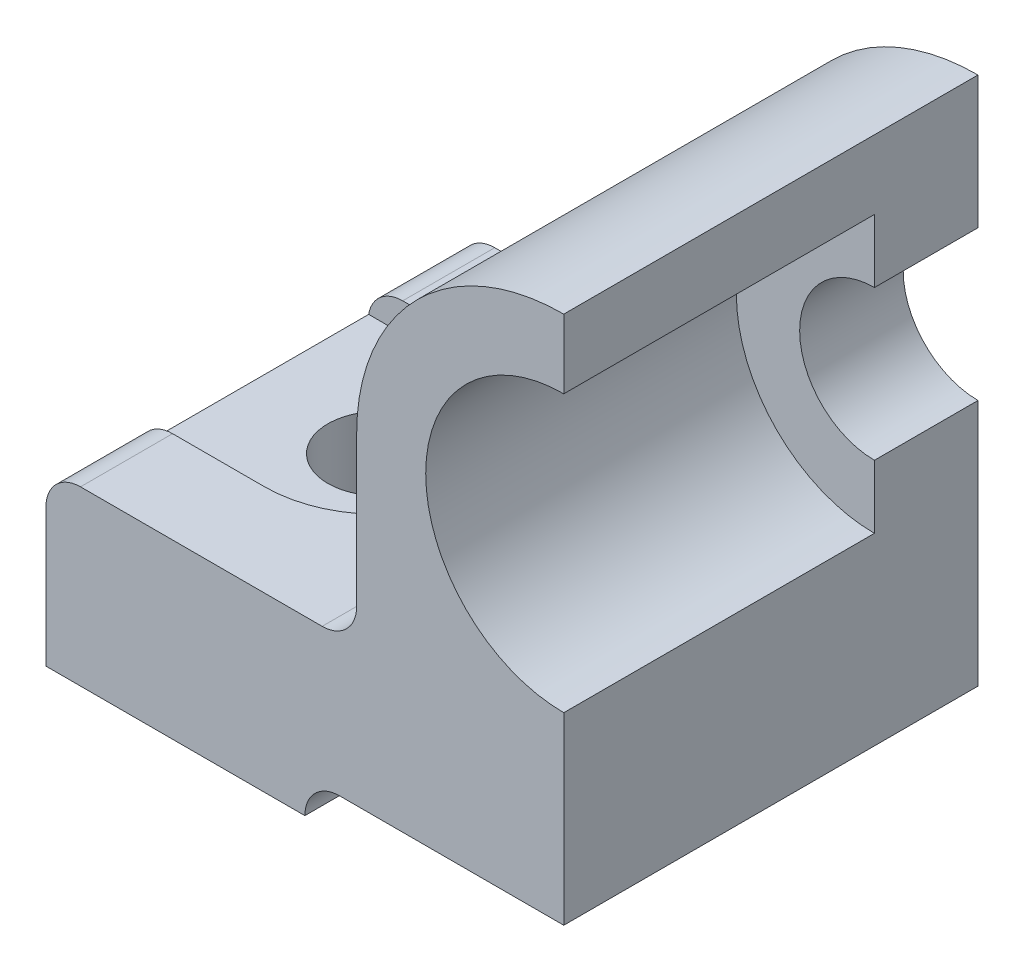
ISO-10303-21;
HEADER;
FILE_DESCRIPTION(('STEP AP214'),'2;1');
FILE_NAME('part.step','',(''),(''),'','','');
FILE_SCHEMA(('AUTOMOTIVE_DESIGN { 1 0 10303 214 1 1 1 1 }'));
ENDSEC;
DATA;
#1=APPLICATION_CONTEXT('core data for automotive mechanical design processes');
#2=APPLICATION_PROTOCOL_DEFINITION('international standard','automotive_design',2000,#1);
#3=PRODUCT_CONTEXT('',#1,'mechanical');
#4=PRODUCT('Part','Part','',(#3));
#5=PRODUCT_RELATED_PRODUCT_CATEGORY('part','',(#4));
#6=PRODUCT_DEFINITION_FORMATION('','',#4);
#7=PRODUCT_DEFINITION_CONTEXT('part definition',#1,'design');
#8=PRODUCT_DEFINITION('design','',#6,#7);
#9=PRODUCT_DEFINITION_SHAPE('','',#8);
#10=(LENGTH_UNIT() NAMED_UNIT(*) SI_UNIT(.MILLI.,.METRE.));
#11=(NAMED_UNIT(*) PLANE_ANGLE_UNIT() SI_UNIT($,.RADIAN.));
#12=(NAMED_UNIT(*) SI_UNIT($,.STERADIAN.) SOLID_ANGLE_UNIT());
#13=UNCERTAINTY_MEASURE_WITH_UNIT(LENGTH_MEASURE(1.E-05),#10,'distance_accuracy_value','');
#14=(GEOMETRIC_REPRESENTATION_CONTEXT(3) GLOBAL_UNCERTAINTY_ASSIGNED_CONTEXT((#13)) GLOBAL_UNIT_ASSIGNED_CONTEXT((#10,
#11,#12)) REPRESENTATION_CONTEXT('',''));
#15=CARTESIAN_POINT('',(0.,0.,0.));
#16=DIRECTION('',(0.,0.,1.));
#17=DIRECTION('',(1.,0.,0.));
#18=AXIS2_PLACEMENT_3D('',#15,#16,#17);
#19=CARTESIAN_POINT('',(0.,0.,-36.));
#20=DIRECTION('',(0.,-1.,0.));
#21=DIRECTION('',(0.,0.,-1.));
#22=AXIS2_PLACEMENT_3D('',#19,#20,#21);
#23=PLANE('',#22);
#24=DIRECTION('',(1.,0.,0.));
#25=VECTOR('',#24,1.);
#26=CARTESIAN_POINT('',(0.,0.,0.));
#27=LINE('',#26,#25);
#28=CARTESIAN_POINT('',(0.,0.,0.));
#29=VERTEX_POINT('',#28);
#30=CARTESIAN_POINT('',(22.5,0.,0.));
#31=VERTEX_POINT('',#30);
#32=EDGE_CURVE('E184',#29,#31,#27,.T.);
#33=ORIENTED_EDGE('',*,*,#32,.F.);
#34=DIRECTION('',(0.,0.,1.));
#35=VECTOR('',#34,1.);
#36=CARTESIAN_POINT('',(0.,0.,-36.));
#37=LINE('',#36,#35);
#38=CARTESIAN_POINT('',(0.,0.,-36.));
#39=VERTEX_POINT('',#38);
#40=EDGE_CURVE('E213',#39,#29,#37,.T.);
#41=ORIENTED_EDGE('',*,*,#40,.F.);
#42=DIRECTION('',(1.,0.,0.));
#43=VECTOR('',#42,1.);
#44=CARTESIAN_POINT('',(0.,0.,-36.));
#45=LINE('',#44,#43);
#46=CARTESIAN_POINT('',(22.5,0.,-36.));
#47=VERTEX_POINT('',#46);
#48=EDGE_CURVE('E200',#39,#47,#45,.T.);
#49=ORIENTED_EDGE('',*,*,#48,.T.);
#50=DIRECTION('',(0.,0.,1.));
#51=VECTOR('',#50,1.);
#52=CARTESIAN_POINT('',(22.5,0.,-36.));
#53=LINE('',#52,#51);
#54=EDGE_CURVE('E218',#47,#31,#53,.T.);
#55=ORIENTED_EDGE('',*,*,#54,.T.);
#56=EDGE_LOOP('',(#33,#41,#49,#55));
#57=FACE_BOUND('',#56,.T.);
#58=CARTESIAN_POINT('',(11.,0.,-18.));
#59=DIRECTION('',(0.,-1.,0.));
#60=DIRECTION('',(0.,0.,-1.));
#61=AXIS2_PLACEMENT_3D('',#58,#59,#60);
#62=CIRCLE('',#61,4.5);
#63=CARTESIAN_POINT('',(11.,0.,-22.5));
#64=VERTEX_POINT('',#63);
#65=EDGE_CURVE('E270',#64,#64,#62,.T.);
#66=ORIENTED_EDGE('',*,*,#65,.F.);
#67=EDGE_LOOP('',(#66));
#68=FACE_BOUND('',#67,.T.);
#69=ADVANCED_FACE('F26',(#57,#68),#23,.T.);
#70=CARTESIAN_POINT('',(11.,12.5,-18.));
#71=DIRECTION('',(0.,1.,0.));
#72=DIRECTION('',(0.,0.,1.));
#73=AXIS2_PLACEMENT_3D('',#70,#71,#72);
#74=PLANE('',#73);
#75=DIRECTION('',(-1.,0.,0.));
#76=VECTOR('',#75,1.);
#77=CARTESIAN_POINT('',(0.,12.5,-8.));
#78=LINE('',#77,#76);
#79=CARTESIAN_POINT('',(11.,12.5,-8.));
#80=VERTEX_POINT('',#79);
#81=CARTESIAN_POINT('',(0.0419601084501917,12.5,-8.));
#82=VERTEX_POINT('',#81);
#83=EDGE_CURVE('E263',#80,#82,#78,.T.);
#84=ORIENTED_EDGE('',*,*,#83,.F.);
#85=CARTESIAN_POINT('',(11.,12.5,-18.));
#86=DIRECTION('',(0.,-1.,0.));
#87=DIRECTION('',(0.,0.,1.));
#88=AXIS2_PLACEMENT_3D('',#85,#86,#87);
#89=CIRCLE('',#88,10.);
#90=CARTESIAN_POINT('',(11.,12.5,-28.));
#91=VERTEX_POINT('',#90);
#92=EDGE_CURVE('E281',#91,#80,#89,.T.);
#93=ORIENTED_EDGE('',*,*,#92,.F.);
#94=DIRECTION('',(1.,0.,0.));
#95=VECTOR('',#94,1.);
#96=CARTESIAN_POINT('',(0.,12.5,-28.));
#97=LINE('',#96,#95);
#98=CARTESIAN_POINT('',(0.0419601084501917,12.5,-28.));
#99=VERTEX_POINT('',#98);
#100=EDGE_CURVE('E283',#99,#91,#97,.T.);
#101=ORIENTED_EDGE('',*,*,#100,.F.);
#102=DIRECTION('',(0.,0.,1.));
#103=VECTOR('',#102,1.);
#104=CARTESIAN_POINT('',(0.0419601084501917,12.5,-36.));
#105=LINE('',#104,#103);
#106=EDGE_CURVE('E247',#82,#99,#105,.F.);
#107=ORIENTED_EDGE('',*,*,#106,.F.);
#108=EDGE_LOOP('',(#84,#93,#101,#107));
#109=FACE_BOUND('',#108,.T.);
#110=CARTESIAN_POINT('',(11.,12.5,-18.));
#111=DIRECTION('',(0.,-1.,0.));
#112=DIRECTION('',(0.,0.,1.));
#113=AXIS2_PLACEMENT_3D('',#110,#111,#112);
#114=CIRCLE('',#113,4.5);
#115=CARTESIAN_POINT('',(11.,12.5,-13.5));
#116=VERTEX_POINT('',#115);
#117=EDGE_CURVE('E275',#116,#116,#114,.T.);
#118=ORIENTED_EDGE('',*,*,#117,.T.);
#119=EDGE_LOOP('',(#118));
#120=FACE_BOUND('',#119,.T.);
#121=ADVANCED_FACE('F291',(#109,#120),#74,.T.);
#122=CARTESIAN_POINT('',(0.,15.,-36.));
#123=DIRECTION('',(0.,1.,0.));
#124=DIRECTION('',(0.,0.,1.));
#125=AXIS2_PLACEMENT_3D('',#122,#123,#124);
#126=PLANE('',#125);
#127=DIRECTION('',(0.,0.,1.));
#128=VECTOR('',#127,1.);
#129=CARTESIAN_POINT('',(3.,15.,-36.));
#130=LINE('',#129,#128);
#131=CARTESIAN_POINT('',(3.,15.,-36.));
#132=VERTEX_POINT('',#131);
#133=CARTESIAN_POINT('',(3.,15.,-28.));
#134=VERTEX_POINT('',#133);
#135=EDGE_CURVE('E230',#132,#134,#130,.T.);
#136=ORIENTED_EDGE('',*,*,#135,.T.);
#137=DIRECTION('',(1.,0.,0.));
#138=VECTOR('',#137,1.);
#139=CARTESIAN_POINT('',(0.,15.,-28.));
#140=LINE('',#139,#138);
#141=CARTESIAN_POINT('',(11.,15.,-28.));
#142=VERTEX_POINT('',#141);
#143=EDGE_CURVE('E272',#134,#142,#140,.T.);
#144=ORIENTED_EDGE('',*,*,#143,.T.);
#145=CARTESIAN_POINT('',(11.,15.,-18.));
#146=DIRECTION('',(0.,-1.,0.));
#147=DIRECTION('',(0.,0.,1.));
#148=AXIS2_PLACEMENT_3D('',#145,#146,#147);
#149=CIRCLE('',#148,10.);
#150=CARTESIAN_POINT('',(11.,15.,-8.));
#151=VERTEX_POINT('',#150);
#152=EDGE_CURVE('E269',#142,#151,#149,.T.);
#153=ORIENTED_EDGE('',*,*,#152,.T.);
#154=DIRECTION('',(-1.,0.,0.));
#155=VECTOR('',#154,1.);
#156=CARTESIAN_POINT('',(0.,15.,-8.));
#157=LINE('',#156,#155);
#158=CARTESIAN_POINT('',(3.,15.,-8.));
#159=VERTEX_POINT('',#158);
#160=EDGE_CURVE('E260',#151,#159,#157,.T.);
#161=ORIENTED_EDGE('',*,*,#160,.T.);
#162=CARTESIAN_POINT('',(3.,15.,0.));
#163=VERTEX_POINT('',#162);
#164=EDGE_CURVE('E229',#159,#163,#130,.T.);
#165=ORIENTED_EDGE('',*,*,#164,.T.);
#166=DIRECTION('',(-1.,0.,0.));
#167=VECTOR('',#166,1.);
#168=CARTESIAN_POINT('',(0.,15.,0.));
#169=LINE('',#168,#167);
#170=CARTESIAN_POINT('',(24.,15.,0.));
#171=VERTEX_POINT('',#170);
#172=EDGE_CURVE('E195',#171,#163,#169,.T.);
#173=ORIENTED_EDGE('',*,*,#172,.F.);
#174=DIRECTION('',(0.,0.,1.));
#175=VECTOR('',#174,1.);
#176=CARTESIAN_POINT('',(24.,15.,-36.));
#177=LINE('',#176,#175);
#178=CARTESIAN_POINT('',(24.,15.,-36.));
#179=VERTEX_POINT('',#178);
#180=EDGE_CURVE('E233',#171,#179,#177,.F.);
#181=ORIENTED_EDGE('',*,*,#180,.T.);
#182=DIRECTION('',(-1.,0.,0.));
#183=VECTOR('',#182,1.);
#184=CARTESIAN_POINT('',(0.,15.,-36.));
#185=LINE('',#184,#183);
#186=EDGE_CURVE('E210',#179,#132,#185,.T.);
#187=ORIENTED_EDGE('',*,*,#186,.T.);
#188=EDGE_LOOP('',(#136,#144,#153,#161,#165,#173,#181,#187));
#189=FACE_BOUND('',#188,.T.);
#190=ADVANCED_FACE('F265',(#189),#126,.T.);
#191=CARTESIAN_POINT('',(3.,12.,-36.));
#192=DIRECTION('',(0.,0.,1.));
#193=DIRECTION('',(1.,0.,0.));
#194=AXIS2_PLACEMENT_3D('',#191,#192,#193);
#195=CYLINDRICAL_SURFACE('',#194,3.);
#196=ORIENTED_EDGE('',*,*,#106,.T.);
#197=CARTESIAN_POINT('',(3.,12.,-28.));
#198=DIRECTION('',(0.,0.,1.));
#199=DIRECTION('',(1.,0.,0.));
#200=AXIS2_PLACEMENT_3D('',#197,#198,#199);
#201=CIRCLE('',#200,3.);
#202=EDGE_CURVE('E11',#99,#134,#201,.F.);
#203=ORIENTED_EDGE('',*,*,#202,.T.);
#204=ORIENTED_EDGE('',*,*,#135,.F.);
#205=CARTESIAN_POINT('',(3.,12.,-36.));
#206=DIRECTION('',(0.,0.,1.));
#207=DIRECTION('',(1.,0.,0.));
#208=AXIS2_PLACEMENT_3D('',#205,#206,#207);
#209=CIRCLE('',#208,3.);
#210=CARTESIAN_POINT('',(0.,12.,-36.));
#211=VERTEX_POINT('',#210);
#212=EDGE_CURVE('E224',#211,#132,#209,.F.);
#213=ORIENTED_EDGE('',*,*,#212,.F.);
#214=DIRECTION('',(0.,0.,1.));
#215=VECTOR('',#214,1.);
#216=CARTESIAN_POINT('',(0.,12.,-36.));
#217=LINE('',#216,#215);
#218=CARTESIAN_POINT('',(0.,12.,0.));
#219=VERTEX_POINT('',#218);
#220=EDGE_CURVE('E235',#219,#211,#217,.F.);
#221=ORIENTED_EDGE('',*,*,#220,.F.);
#222=CARTESIAN_POINT('',(3.,12.,0.));
#223=DIRECTION('',(0.,0.,1.));
#224=DIRECTION('',(1.,0.,0.));
#225=AXIS2_PLACEMENT_3D('',#222,#223,#224);
#226=CIRCLE('',#225,3.);
#227=EDGE_CURVE('E217',#163,#219,#226,.T.);
#228=ORIENTED_EDGE('',*,*,#227,.F.);
#229=ORIENTED_EDGE('',*,*,#164,.F.);
#230=CARTESIAN_POINT('',(3.,12.,-8.));
#231=DIRECTION('',(0.,0.,-1.));
#232=DIRECTION('',(-1.,0.,0.));
#233=AXIS2_PLACEMENT_3D('',#230,#231,#232);
#234=CIRCLE('',#233,3.);
#235=EDGE_CURVE('E34',#159,#82,#234,.F.);
#236=ORIENTED_EDGE('',*,*,#235,.T.);
#237=EDGE_LOOP('',(#196,#203,#204,#213,#221,#228,#229,#236));
#238=FACE_BOUND('',#237,.T.);
#239=ADVANCED_FACE('F252',(#238),#195,.T.);
#240=CARTESIAN_POINT('',(0.,0.,-36.));
#241=DIRECTION('',(-1.,0.,0.));
#242=DIRECTION('',(0.,0.,1.));
#243=AXIS2_PLACEMENT_3D('',#240,#241,#242);
#244=PLANE('',#243);
#245=DIRECTION('',(0.,-1.,0.));
#246=VECTOR('',#245,1.);
#247=CARTESIAN_POINT('',(0.,0.,0.));
#248=LINE('',#247,#246);
#249=EDGE_CURVE('E182',#219,#29,#248,.T.);
#250=ORIENTED_EDGE('',*,*,#249,.F.);
#251=ORIENTED_EDGE('',*,*,#220,.T.);
#252=DIRECTION('',(0.,-1.,0.));
#253=VECTOR('',#252,1.);
#254=CARTESIAN_POINT('',(0.,0.,-36.));
#255=LINE('',#254,#253);
#256=EDGE_CURVE('E198',#211,#39,#255,.T.);
#257=ORIENTED_EDGE('',*,*,#256,.T.);
#258=ORIENTED_EDGE('',*,*,#40,.T.);
#259=EDGE_LOOP('',(#250,#251,#257,#258));
#260=FACE_BOUND('',#259,.T.);
#261=ADVANCED_FACE('F28',(#260),#244,.T.);
#262=CARTESIAN_POINT('',(27.,15.,-36.));
#263=DIRECTION('',(-1.,0.,0.));
#264=DIRECTION('',(0.,0.,1.));
#265=AXIS2_PLACEMENT_3D('',#262,#263,#264);
#266=PLANE('',#265);
#267=DIRECTION('',(0.,-1.,0.));
#268=VECTOR('',#267,1.);
#269=CARTESIAN_POINT('',(27.,15.,-36.));
#270=LINE('',#269,#268);
#271=CARTESIAN_POINT('',(27.,31.,-36.));
#272=VERTEX_POINT('',#271);
#273=CARTESIAN_POINT('',(27.,18.,-36.));
#274=VERTEX_POINT('',#273);
#275=EDGE_CURVE('E207',#272,#274,#270,.T.);
#276=ORIENTED_EDGE('',*,*,#275,.T.);
#277=DIRECTION('',(0.,0.,1.));
#278=VECTOR('',#277,1.);
#279=CARTESIAN_POINT('',(27.,18.,0.));
#280=LINE('',#279,#278);
#281=CARTESIAN_POINT('',(27.,18.,0.));
#282=VERTEX_POINT('',#281);
#283=EDGE_CURVE('E226',#274,#282,#280,.T.);
#284=ORIENTED_EDGE('',*,*,#283,.T.);
#285=DIRECTION('',(0.,-1.,0.));
#286=VECTOR('',#285,1.);
#287=CARTESIAN_POINT('',(27.,15.,0.));
#288=LINE('',#287,#286);
#289=CARTESIAN_POINT('',(27.,31.,0.));
#290=VERTEX_POINT('',#289);
#291=EDGE_CURVE('E192',#290,#282,#288,.T.);
#292=ORIENTED_EDGE('',*,*,#291,.F.);
#293=DIRECTION('',(0.,0.,1.));
#294=VECTOR('',#293,1.);
#295=CARTESIAN_POINT('',(27.,31.,-36.));
#296=LINE('',#295,#294);
#297=EDGE_CURVE('E214',#272,#290,#296,.T.);
#298=ORIENTED_EDGE('',*,*,#297,.F.);
#299=EDGE_LOOP('',(#276,#284,#292,#298));
#300=FACE_BOUND('',#299,.T.);
#301=ADVANCED_FACE('F307',(#300),#266,.T.);
#302=CARTESIAN_POINT('',(45.,31.,-36.));
#303=DIRECTION('',(0.,0.,1.));
#304=DIRECTION('',(1.,0.,0.));
#305=AXIS2_PLACEMENT_3D('',#302,#303,#304);
#306=CYLINDRICAL_SURFACE('',#305,18.);
#307=DIRECTION('',(0.,0.,1.));
#308=VECTOR('',#307,1.);
#309=CARTESIAN_POINT('',(45.,49.,-36.));
#310=LINE('',#309,#308);
#311=CARTESIAN_POINT('',(45.,49.,0.));
#312=VERTEX_POINT('',#311);
#313=CARTESIAN_POINT('',(45.,49.,-36.));
#314=VERTEX_POINT('',#313);
#315=EDGE_CURVE('E165',#312,#314,#310,.F.);
#316=ORIENTED_EDGE('',*,*,#315,.T.);
#317=CARTESIAN_POINT('',(45.,31.,-36.));
#318=DIRECTION('',(0.,0.,1.));
#319=DIRECTION('',(1.,0.,0.));
#320=AXIS2_PLACEMENT_3D('',#317,#318,#319);
#321=CIRCLE('',#320,18.);
#322=EDGE_CURVE('E164',#314,#272,#321,.T.);
#323=ORIENTED_EDGE('',*,*,#322,.T.);
#324=ORIENTED_EDGE('',*,*,#297,.T.);
#325=CARTESIAN_POINT('',(45.,31.,0.));
#326=DIRECTION('',(0.,0.,1.));
#327=DIRECTION('',(1.,0.,0.));
#328=AXIS2_PLACEMENT_3D('',#325,#326,#327);
#329=CIRCLE('',#328,18.);
#330=EDGE_CURVE('E190',#312,#290,#329,.T.);
#331=ORIENTED_EDGE('',*,*,#330,.F.);
#332=EDGE_LOOP('',(#316,#323,#324,#331));
#333=FACE_BOUND('',#332,.T.);
#334=ADVANCED_FACE('F315',(#333),#306,.T.);
#335=CARTESIAN_POINT('',(22.5,3.,-36.));
#336=DIRECTION('',(0.,-1.,0.));
#337=DIRECTION('',(0.,0.,-1.));
#338=AXIS2_PLACEMENT_3D('',#335,#336,#337);
#339=PLANE('',#338);
#340=DIRECTION('',(0.,0.,1.));
#341=VECTOR('',#340,1.);
#342=CARTESIAN_POINT('',(45.,3.,-42.1793299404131));
#343=LINE('',#342,#341);
#344=CARTESIAN_POINT('',(45.,3.,-36.));
#345=VERTEX_POINT('',#344);
#346=CARTESIAN_POINT('',(45.,3.,0.));
#347=VERTEX_POINT('',#346);
#348=EDGE_CURVE('E324',#345,#347,#343,.T.);
#349=ORIENTED_EDGE('',*,*,#348,.T.);
#350=DIRECTION('',(1.,0.,0.));
#351=VECTOR('',#350,1.);
#352=CARTESIAN_POINT('',(22.5,3.,0.));
#353=LINE('',#352,#351);
#354=CARTESIAN_POINT('',(25.5,3.,0.));
#355=VERTEX_POINT('',#354);
#356=EDGE_CURVE('E187',#355,#347,#353,.T.);
#357=ORIENTED_EDGE('',*,*,#356,.F.);
#358=DIRECTION('',(0.,0.,1.));
#359=VECTOR('',#358,1.);
#360=CARTESIAN_POINT('',(25.5,3.,-36.));
#361=LINE('',#360,#359);
#362=CARTESIAN_POINT('',(25.5,3.,-36.));
#363=VERTEX_POINT('',#362);
#364=EDGE_CURVE('E237',#355,#363,#361,.F.);
#365=ORIENTED_EDGE('',*,*,#364,.T.);
#366=DIRECTION('',(1.,0.,0.));
#367=VECTOR('',#366,1.);
#368=CARTESIAN_POINT('',(22.5,3.,-36.));
#369=LINE('',#368,#367);
#370=EDGE_CURVE('E203',#363,#345,#369,.T.);
#371=ORIENTED_EDGE('',*,*,#370,.T.);
#372=EDGE_LOOP('',(#349,#357,#365,#371));
#373=FACE_BOUND('',#372,.T.);
#374=ADVANCED_FACE('F351',(#373),#339,.T.);
#375=CARTESIAN_POINT('',(45.,31.,-36.));
#376=DIRECTION('',(0.,0.,1.));
#377=DIRECTION('',(1.,0.,0.));
#378=AXIS2_PLACEMENT_3D('',#375,#376,#377);
#379=PLANE('',#378);
#380=ORIENTED_EDGE('',*,*,#322,.F.);
#381=DIRECTION('',(0.,1.,0.));
#382=VECTOR('',#381,1.);
#383=CARTESIAN_POINT('',(45.,52.1783681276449,-36.));
#384=LINE('',#383,#382);
#385=CARTESIAN_POINT('',(45.,37.5,-36.));
#386=VERTEX_POINT('',#385);
#387=EDGE_CURVE('E151',#386,#314,#384,.T.);
#388=ORIENTED_EDGE('',*,*,#387,.F.);
#389=CARTESIAN_POINT('',(45.,31.,-36.));
#390=DIRECTION('',(0.,0.,1.));
#391=DIRECTION('',(1.,0.,0.));
#392=AXIS2_PLACEMENT_3D('',#389,#390,#391);
#393=CIRCLE('',#392,6.5);
#394=CARTESIAN_POINT('',(45.,24.5,-36.));
#395=VERTEX_POINT('',#394);
#396=EDGE_CURVE('E162',#386,#395,#393,.T.);
#397=ORIENTED_EDGE('',*,*,#396,.T.);
#398=EDGE_CURVE('E49',#345,#395,#384,.T.);
#399=ORIENTED_EDGE('',*,*,#398,.F.);
#400=ORIENTED_EDGE('',*,*,#370,.F.);
#401=CARTESIAN_POINT('',(25.5,0.,-36.));
#402=DIRECTION('',(0.,0.,1.));
#403=DIRECTION('',(1.,0.,0.));
#404=AXIS2_PLACEMENT_3D('',#401,#402,#403);
#405=CIRCLE('',#404,3.);
#406=EDGE_CURVE('E245',#363,#47,#405,.T.);
#407=ORIENTED_EDGE('',*,*,#406,.T.);
#408=ORIENTED_EDGE('',*,*,#48,.F.);
#409=ORIENTED_EDGE('',*,*,#256,.F.);
#410=ORIENTED_EDGE('',*,*,#212,.T.);
#411=ORIENTED_EDGE('',*,*,#186,.F.);
#412=CARTESIAN_POINT('',(24.,18.,-36.));
#413=DIRECTION('',(0.,0.,1.));
#414=DIRECTION('',(1.,0.,0.));
#415=AXIS2_PLACEMENT_3D('',#412,#413,#414);
#416=CIRCLE('',#415,3.);
#417=EDGE_CURVE('E241',#179,#274,#416,.T.);
#418=ORIENTED_EDGE('',*,*,#417,.T.);
#419=ORIENTED_EDGE('',*,*,#275,.F.);
#420=EDGE_LOOP('',(#380,#388,#397,#399,#400,#407,#408,#409,#410,#411,#418,#419));
#421=FACE_BOUND('',#420,.T.);
#422=ADVANCED_FACE('F161',(#421),#379,.F.);
#423=CARTESIAN_POINT('',(45.,31.,0.));
#424=DIRECTION('',(0.,0.,1.));
#425=DIRECTION('',(1.,0.,0.));
#426=AXIS2_PLACEMENT_3D('',#423,#424,#425);
#427=PLANE('',#426);
#428=DIRECTION('',(0.,1.,0.));
#429=VECTOR('',#428,1.);
#430=CARTESIAN_POINT('',(45.,52.1783681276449,0.));
#431=LINE('',#430,#429);
#432=CARTESIAN_POINT('',(45.,43.,0.));
#433=VERTEX_POINT('',#432);
#434=EDGE_CURVE('E166',#433,#312,#431,.T.);
#435=ORIENTED_EDGE('',*,*,#434,.T.);
#436=ORIENTED_EDGE('',*,*,#330,.T.);
#437=ORIENTED_EDGE('',*,*,#291,.T.);
#438=CARTESIAN_POINT('',(24.,18.,0.));
#439=DIRECTION('',(0.,0.,1.));
#440=DIRECTION('',(1.,0.,0.));
#441=AXIS2_PLACEMENT_3D('',#438,#439,#440);
#442=CIRCLE('',#441,3.);
#443=EDGE_CURVE('E239',#282,#171,#442,.F.);
#444=ORIENTED_EDGE('',*,*,#443,.T.);
#445=ORIENTED_EDGE('',*,*,#172,.T.);
#446=ORIENTED_EDGE('',*,*,#227,.T.);
#447=ORIENTED_EDGE('',*,*,#249,.T.);
#448=ORIENTED_EDGE('',*,*,#32,.T.);
#449=CARTESIAN_POINT('',(25.5,0.,0.));
#450=DIRECTION('',(0.,0.,1.));
#451=DIRECTION('',(1.,0.,0.));
#452=AXIS2_PLACEMENT_3D('',#449,#450,#451);
#453=CIRCLE('',#452,3.);
#454=EDGE_CURVE('E243',#31,#355,#453,.F.);
#455=ORIENTED_EDGE('',*,*,#454,.T.);
#456=ORIENTED_EDGE('',*,*,#356,.T.);
#457=CARTESIAN_POINT('',(45.,19.,0.));
#458=VERTEX_POINT('',#457);
#459=EDGE_CURVE('E323',#347,#458,#431,.T.);
#460=ORIENTED_EDGE('',*,*,#459,.T.);
#461=CARTESIAN_POINT('',(45.,31.,0.));
#462=DIRECTION('',(0.,0.,1.));
#463=DIRECTION('',(1.,0.,0.));
#464=AXIS2_PLACEMENT_3D('',#461,#462,#463);
#465=CIRCLE('',#464,12.);
#466=EDGE_CURVE('E170',#433,#458,#465,.T.);
#467=ORIENTED_EDGE('',*,*,#466,.F.);
#468=EDGE_LOOP('',(#435,#436,#437,#444,#445,#446,#447,#448,#455,#456,#460,#467));
#469=FACE_BOUND('',#468,.T.);
#470=ADVANCED_FACE('F311',(#469),#427,.T.);
#471=CARTESIAN_POINT('',(45.,31.,-27.));
#472=DIRECTION('',(0.,0.,1.));
#473=DIRECTION('',(1.,0.,0.));
#474=AXIS2_PLACEMENT_3D('',#471,#472,#473);
#475=CYLINDRICAL_SURFACE('',#474,12.);
#476=CARTESIAN_POINT('',(45.,31.,-27.));
#477=DIRECTION('',(0.,0.,1.));
#478=DIRECTION('',(1.,0.,0.));
#479=AXIS2_PLACEMENT_3D('',#476,#477,#478);
#480=CIRCLE('',#479,12.);
#481=CARTESIAN_POINT('',(45.,43.,-27.));
#482=VERTEX_POINT('',#481);
#483=CARTESIAN_POINT('',(45.,19.,-27.));
#484=VERTEX_POINT('',#483);
#485=EDGE_CURVE('E174',#482,#484,#480,.T.);
#486=ORIENTED_EDGE('',*,*,#485,.F.);
#487=DIRECTION('',(0.,0.,1.));
#488=VECTOR('',#487,1.);
#489=CARTESIAN_POINT('',(45.,43.,-27.));
#490=LINE('',#489,#488);
#491=EDGE_CURVE('E466',#433,#482,#490,.F.);
#492=ORIENTED_EDGE('',*,*,#491,.F.);
#493=ORIENTED_EDGE('',*,*,#466,.T.);
#494=DIRECTION('',(0.,0.,1.));
#495=VECTOR('',#494,1.);
#496=CARTESIAN_POINT('',(45.,19.,-27.));
#497=LINE('',#496,#495);
#498=EDGE_CURVE('E321',#484,#458,#497,.T.);
#499=ORIENTED_EDGE('',*,*,#498,.F.);
#500=EDGE_LOOP('',(#486,#492,#493,#499));
#501=FACE_BOUND('',#500,.T.);
#502=ADVANCED_FACE('F364',(#501),#475,.F.);
#503=CARTESIAN_POINT('',(45.,31.,-27.));
#504=DIRECTION('',(0.,0.,1.));
#505=DIRECTION('',(1.,0.,0.));
#506=AXIS2_PLACEMENT_3D('',#503,#504,#505);
#507=PLANE('',#506);
#508=DIRECTION('',(0.,1.,0.));
#509=VECTOR('',#508,1.);
#510=CARTESIAN_POINT('',(45.,52.1783681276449,-27.));
#511=LINE('',#510,#509);
#512=CARTESIAN_POINT('',(45.,37.5,-27.));
#513=VERTEX_POINT('',#512);
#514=EDGE_CURVE('E41',#513,#482,#511,.T.);
#515=ORIENTED_EDGE('',*,*,#514,.T.);
#516=ORIENTED_EDGE('',*,*,#485,.T.);
#517=CARTESIAN_POINT('',(45.,24.5,-27.));
#518=VERTEX_POINT('',#517);
#519=EDGE_CURVE('E317',#484,#518,#511,.T.);
#520=ORIENTED_EDGE('',*,*,#519,.T.);
#521=CARTESIAN_POINT('',(45.,31.,-27.));
#522=DIRECTION('',(0.,0.,1.));
#523=DIRECTION('',(1.,0.,0.));
#524=AXIS2_PLACEMENT_3D('',#521,#522,#523);
#525=CIRCLE('',#524,6.5);
#526=EDGE_CURVE('E171',#513,#518,#525,.T.);
#527=ORIENTED_EDGE('',*,*,#526,.F.);
#528=EDGE_LOOP('',(#515,#516,#520,#527));
#529=FACE_BOUND('',#528,.T.);
#530=ADVANCED_FACE('F367',(#529),#507,.T.);
#531=CARTESIAN_POINT('',(45.,31.,-36.));
#532=DIRECTION('',(0.,0.,1.));
#533=DIRECTION('',(1.,0.,0.));
#534=AXIS2_PLACEMENT_3D('',#531,#532,#533);
#535=CYLINDRICAL_SURFACE('',#534,6.5);
#536=ORIENTED_EDGE('',*,*,#396,.F.);
#537=DIRECTION('',(0.,0.,1.));
#538=VECTOR('',#537,1.);
#539=CARTESIAN_POINT('',(45.,37.5,-36.));
#540=LINE('',#539,#538);
#541=EDGE_CURVE('E148',#513,#386,#540,.F.);
#542=ORIENTED_EDGE('',*,*,#541,.F.);
#543=ORIENTED_EDGE('',*,*,#526,.T.);
#544=DIRECTION('',(0.,0.,1.));
#545=VECTOR('',#544,1.);
#546=CARTESIAN_POINT('',(45.,24.5,-36.));
#547=LINE('',#546,#545);
#548=EDGE_CURVE('E169',#395,#518,#547,.T.);
#549=ORIENTED_EDGE('',*,*,#548,.F.);
#550=EDGE_LOOP('',(#536,#542,#543,#549));
#551=FACE_BOUND('',#550,.T.);
#552=ADVANCED_FACE('F168',(#551),#535,.F.);
#553=CARTESIAN_POINT('',(24.,18.,-36.));
#554=DIRECTION('',(0.,0.,-1.));
#555=DIRECTION('',(-1.,0.,0.));
#556=AXIS2_PLACEMENT_3D('',#553,#554,#555);
#557=CYLINDRICAL_SURFACE('',#556,3.);
#558=ORIENTED_EDGE('',*,*,#417,.F.);
#559=ORIENTED_EDGE('',*,*,#180,.F.);
#560=ORIENTED_EDGE('',*,*,#443,.F.);
#561=ORIENTED_EDGE('',*,*,#283,.F.);
#562=EDGE_LOOP('',(#558,#559,#560,#561));
#563=FACE_BOUND('',#562,.T.);
#564=ADVANCED_FACE('F304',(#563),#557,.F.);
#565=CARTESIAN_POINT('',(25.5,0.,-36.));
#566=DIRECTION('',(0.,0.,-1.));
#567=DIRECTION('',(-1.,0.,0.));
#568=AXIS2_PLACEMENT_3D('',#565,#566,#567);
#569=CYLINDRICAL_SURFACE('',#568,3.);
#570=ORIENTED_EDGE('',*,*,#406,.F.);
#571=ORIENTED_EDGE('',*,*,#364,.F.);
#572=ORIENTED_EDGE('',*,*,#454,.F.);
#573=ORIENTED_EDGE('',*,*,#54,.F.);
#574=EDGE_LOOP('',(#570,#571,#572,#573));
#575=FACE_BOUND('',#574,.T.);
#576=ADVANCED_FACE('F376',(#575),#569,.F.);
#577=CARTESIAN_POINT('',(0.,12.5,-28.));
#578=DIRECTION('',(0.,0.,1.));
#579=DIRECTION('',(1.,0.,0.));
#580=AXIS2_PLACEMENT_3D('',#577,#578,#579);
#581=PLANE('',#580);
#582=ORIENTED_EDGE('',*,*,#100,.T.);
#583=DIRECTION('',(0.,1.,0.));
#584=VECTOR('',#583,1.);
#585=CARTESIAN_POINT('',(11.,12.5,-28.));
#586=LINE('',#585,#584);
#587=EDGE_CURVE('E176',#91,#142,#586,.T.);
#588=ORIENTED_EDGE('',*,*,#587,.T.);
#589=ORIENTED_EDGE('',*,*,#143,.F.);
#590=ORIENTED_EDGE('',*,*,#202,.F.);
#591=EDGE_LOOP('',(#582,#588,#589,#590));
#592=FACE_BOUND('',#591,.T.);
#593=ADVANCED_FACE('F295',(#592),#581,.T.);
#594=CARTESIAN_POINT('',(11.,12.5,-18.));
#595=DIRECTION('',(0.,1.,0.));
#596=DIRECTION('',(0.,0.,1.));
#597=AXIS2_PLACEMENT_3D('',#594,#595,#596);
#598=CYLINDRICAL_SURFACE('',#597,10.);
#599=ORIENTED_EDGE('',*,*,#152,.F.);
#600=ORIENTED_EDGE('',*,*,#587,.F.);
#601=ORIENTED_EDGE('',*,*,#92,.T.);
#602=DIRECTION('',(0.,1.,0.));
#603=VECTOR('',#602,1.);
#604=CARTESIAN_POINT('',(11.,12.5,-8.));
#605=LINE('',#604,#603);
#606=EDGE_CURVE('E285',#80,#151,#605,.T.);
#607=ORIENTED_EDGE('',*,*,#606,.T.);
#608=EDGE_LOOP('',(#599,#600,#601,#607));
#609=FACE_BOUND('',#608,.T.);
#610=ADVANCED_FACE('F287',(#609),#598,.F.);
#611=CARTESIAN_POINT('',(0.,12.5,-8.));
#612=DIRECTION('',(0.,0.,-1.));
#613=DIRECTION('',(-1.,0.,0.));
#614=AXIS2_PLACEMENT_3D('',#611,#612,#613);
#615=PLANE('',#614);
#616=ORIENTED_EDGE('',*,*,#160,.F.);
#617=ORIENTED_EDGE('',*,*,#606,.F.);
#618=ORIENTED_EDGE('',*,*,#83,.T.);
#619=ORIENTED_EDGE('',*,*,#235,.F.);
#620=EDGE_LOOP('',(#616,#617,#618,#619));
#621=FACE_BOUND('',#620,.T.);
#622=ADVANCED_FACE('F258',(#621),#615,.T.);
#623=CARTESIAN_POINT('',(11.,-0.000999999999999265,-18.));
#624=DIRECTION('',(0.,1.,0.));
#625=DIRECTION('',(0.,0.,1.));
#626=AXIS2_PLACEMENT_3D('',#623,#624,#625);
#627=CYLINDRICAL_SURFACE('',#626,4.5);
#628=ORIENTED_EDGE('',*,*,#65,.T.);
#629=EDGE_LOOP('',(#628));
#630=FACE_BOUND('',#629,.T.);
#631=ORIENTED_EDGE('',*,*,#117,.F.);
#632=EDGE_LOOP('',(#631));
#633=FACE_BOUND('',#632,.T.);
#634=ADVANCED_FACE('F329',(#630,#633),#627,.F.);
#635=CARTESIAN_POINT('',(45.,52.1783681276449,-42.1793299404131));
#636=DIRECTION('',(-1.,0.,0.));
#637=DIRECTION('',(0.,0.,1.));
#638=AXIS2_PLACEMENT_3D('',#635,#636,#637);
#639=PLANE('',#638);
#640=ORIENTED_EDGE('',*,*,#398,.T.);
#641=ORIENTED_EDGE('',*,*,#548,.T.);
#642=ORIENTED_EDGE('',*,*,#519,.F.);
#643=ORIENTED_EDGE('',*,*,#498,.T.);
#644=ORIENTED_EDGE('',*,*,#459,.F.);
#645=ORIENTED_EDGE('',*,*,#348,.F.);
#646=EDGE_LOOP('',(#640,#641,#642,#643,#644,#645));
#647=FACE_BOUND('',#646,.T.);
#648=ADVANCED_FACE('F331',(#647),#639,.F.);
#649=ORIENTED_EDGE('',*,*,#434,.F.);
#650=ORIENTED_EDGE('',*,*,#491,.T.);
#651=ORIENTED_EDGE('',*,*,#514,.F.);
#652=ORIENTED_EDGE('',*,*,#541,.T.);
#653=ORIENTED_EDGE('',*,*,#387,.T.);
#654=ORIENTED_EDGE('',*,*,#315,.F.);
#655=EDGE_LOOP('',(#649,#650,#651,#652,#653,#654));
#656=FACE_BOUND('',#655,.T.);
#657=ADVANCED_FACE('F150',(#656),#639,.F.);
#658=CLOSED_SHELL('',(#69,#121,#190,#239,#261,#301,#334,#374,#422,#470,#502,#530,#552,#564,#576,
#593,#610,#622,#634,#648,#657));
#659=MANIFOLD_SOLID_BREP('B2',#658);
#660=ADVANCED_BREP_SHAPE_REPRESENTATION('',(#18,#659),#14);
#661=SHAPE_DEFINITION_REPRESENTATION(#9,#660);
ENDSEC;
END-ISO-10303-21;
